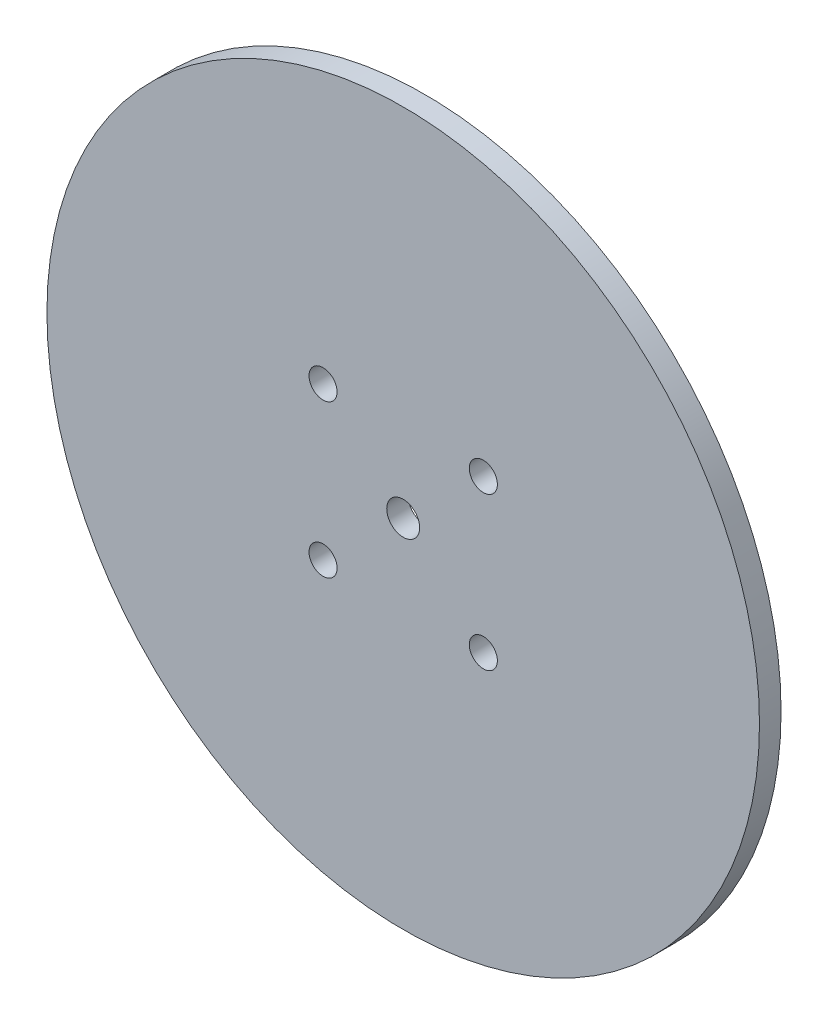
ISO-10303-21;
HEADER;
FILE_DESCRIPTION(('STEP AP214'),'2;1');
FILE_NAME('part.step','',(''),(''),'','','');
FILE_SCHEMA(('AUTOMOTIVE_DESIGN { 1 0 10303 214 1 1 1 1 }'));
ENDSEC;
DATA;
#1=APPLICATION_CONTEXT('core data for automotive mechanical design processes');
#2=APPLICATION_PROTOCOL_DEFINITION('international standard','automotive_design',2000,#1);
#3=PRODUCT_CONTEXT('',#1,'mechanical');
#4=PRODUCT('Part','Part','',(#3));
#5=PRODUCT_RELATED_PRODUCT_CATEGORY('part','',(#4));
#6=PRODUCT_DEFINITION_FORMATION('','',#4);
#7=PRODUCT_DEFINITION_CONTEXT('part definition',#1,'design');
#8=PRODUCT_DEFINITION('design','',#6,#7);
#9=PRODUCT_DEFINITION_SHAPE('','',#8);
#10=(LENGTH_UNIT() NAMED_UNIT(*) SI_UNIT(.MILLI.,.METRE.));
#11=(NAMED_UNIT(*) PLANE_ANGLE_UNIT() SI_UNIT($,.RADIAN.));
#12=(NAMED_UNIT(*) SI_UNIT($,.STERADIAN.) SOLID_ANGLE_UNIT());
#13=UNCERTAINTY_MEASURE_WITH_UNIT(LENGTH_MEASURE(1.E-05),#10,'distance_accuracy_value','');
#14=(GEOMETRIC_REPRESENTATION_CONTEXT(3) GLOBAL_UNCERTAINTY_ASSIGNED_CONTEXT((#13)) GLOBAL_UNIT_ASSIGNED_CONTEXT((#10,
#11,#12)) REPRESENTATION_CONTEXT('',''));
#15=CARTESIAN_POINT('',(0.,0.,0.));
#16=DIRECTION('',(0.,0.,1.));
#17=DIRECTION('',(1.,0.,0.));
#18=AXIS2_PLACEMENT_3D('',#15,#16,#17);
#19=CARTESIAN_POINT('',(0.,0.,4.));
#20=DIRECTION('',(0.,0.,-1.));
#21=DIRECTION('',(-1.,0.,0.));
#22=AXIS2_PLACEMENT_3D('',#19,#20,#21);
#23=CYLINDRICAL_SURFACE('',#22,66.);
#24=CARTESIAN_POINT('',(0.,0.,4.));
#25=DIRECTION('',(0.,0.,1.));
#26=DIRECTION('',(1.,0.,0.));
#27=AXIS2_PLACEMENT_3D('',#24,#25,#26);
#28=CIRCLE('',#27,66.);
#29=CARTESIAN_POINT('',(66.,0.,4.));
#30=VERTEX_POINT('',#29);
#31=EDGE_CURVE('E10',#30,#30,#28,.T.);
#32=ORIENTED_EDGE('',*,*,#31,.F.);
#33=EDGE_LOOP('',(#32));
#34=FACE_BOUND('',#33,.T.);
#35=CARTESIAN_POINT('',(0.,0.,0.));
#36=DIRECTION('',(0.,0.,1.));
#37=DIRECTION('',(1.,0.,0.));
#38=AXIS2_PLACEMENT_3D('',#35,#36,#37);
#39=CIRCLE('',#38,66.);
#40=CARTESIAN_POINT('',(66.,0.,0.));
#41=VERTEX_POINT('',#40);
#42=EDGE_CURVE('E46',#41,#41,#39,.T.);
#43=ORIENTED_EDGE('',*,*,#42,.T.);
#44=EDGE_LOOP('',(#43));
#45=FACE_BOUND('',#44,.T.);
#46=ADVANCED_FACE('F43',(#34,#45),#23,.T.);
#47=CARTESIAN_POINT('',(0.,0.,4.));
#48=DIRECTION('',(0.,0.,1.));
#49=DIRECTION('',(1.,0.,0.));
#50=AXIS2_PLACEMENT_3D('',#47,#48,#49);
#51=PLANE('',#50);
#52=CARTESIAN_POINT('',(0.,0.,4.));
#53=DIRECTION('',(0.,0.,-1.));
#54=DIRECTION('',(-1.,0.,0.));
#55=AXIS2_PLACEMENT_3D('',#52,#53,#54);
#56=CIRCLE('',#55,3.05);
#57=CARTESIAN_POINT('',(-3.05,0.,4.));
#58=VERTEX_POINT('',#57);
#59=EDGE_CURVE('E67',#58,#58,#56,.T.);
#60=ORIENTED_EDGE('',*,*,#59,.T.);
#61=EDGE_LOOP('',(#60));
#62=FACE_BOUND('',#61,.T.);
#63=CARTESIAN_POINT('',(14.845865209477,-14.136841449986,4.));
#64=DIRECTION('',(0.,0.,-1.));
#65=DIRECTION('',(-1.,0.,0.));
#66=AXIS2_PLACEMENT_3D('',#63,#64,#65);
#67=CIRCLE('',#66,2.6);
#68=CARTESIAN_POINT('',(12.245865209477,-14.136841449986,4.));
#69=VERTEX_POINT('',#68);
#70=EDGE_CURVE('E62',#69,#69,#67,.T.);
#71=ORIENTED_EDGE('',*,*,#70,.T.);
#72=EDGE_LOOP('',(#71));
#73=FACE_BOUND('',#72,.T.);
#74=CARTESIAN_POINT('',(-14.845865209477,-14.136841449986,4.));
#75=DIRECTION('',(0.,0.,-1.));
#76=DIRECTION('',(-1.,0.,0.));
#77=AXIS2_PLACEMENT_3D('',#74,#75,#76);
#78=CIRCLE('',#77,2.6);
#79=CARTESIAN_POINT('',(-17.445865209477,-14.136841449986,4.));
#80=VERTEX_POINT('',#79);
#81=EDGE_CURVE('E74',#80,#80,#78,.T.);
#82=ORIENTED_EDGE('',*,*,#81,.T.);
#83=EDGE_LOOP('',(#82));
#84=FACE_BOUND('',#83,.T.);
#85=CARTESIAN_POINT('',(-14.845865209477,14.136841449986,4.));
#86=DIRECTION('',(0.,0.,-1.));
#87=DIRECTION('',(-1.,0.,0.));
#88=AXIS2_PLACEMENT_3D('',#85,#86,#87);
#89=CIRCLE('',#88,2.6);
#90=CARTESIAN_POINT('',(-17.445865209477,14.136841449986,4.));
#91=VERTEX_POINT('',#90);
#92=EDGE_CURVE('E85',#91,#91,#89,.T.);
#93=ORIENTED_EDGE('',*,*,#92,.T.);
#94=EDGE_LOOP('',(#93));
#95=FACE_BOUND('',#94,.T.);
#96=CARTESIAN_POINT('',(14.845865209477,14.136841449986,4.));
#97=DIRECTION('',(0.,0.,-1.));
#98=DIRECTION('',(-1.,0.,0.));
#99=AXIS2_PLACEMENT_3D('',#96,#97,#98);
#100=CIRCLE('',#99,2.60000000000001);
#101=CARTESIAN_POINT('',(12.245865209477,14.136841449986,4.));
#102=VERTEX_POINT('',#101);
#103=EDGE_CURVE('E54',#102,#102,#100,.T.);
#104=ORIENTED_EDGE('',*,*,#103,.T.);
#105=EDGE_LOOP('',(#104));
#106=FACE_BOUND('',#105,.T.);
#107=ORIENTED_EDGE('',*,*,#31,.T.);
#108=EDGE_LOOP('',(#107));
#109=FACE_BOUND('',#108,.T.);
#110=ADVANCED_FACE('F97',(#62,#73,#84,#95,#106,#109),#51,.T.);
#111=CARTESIAN_POINT('',(0.,0.,0.));
#112=DIRECTION('',(0.,0.,1.));
#113=DIRECTION('',(1.,0.,0.));
#114=AXIS2_PLACEMENT_3D('',#111,#112,#113);
#115=PLANE('',#114);
#116=CARTESIAN_POINT('',(0.,0.,0.));
#117=DIRECTION('',(0.,0.,-1.));
#118=DIRECTION('',(-1.,0.,0.));
#119=AXIS2_PLACEMENT_3D('',#116,#117,#118);
#120=CIRCLE('',#119,3.05);
#121=CARTESIAN_POINT('',(-3.05,0.,0.));
#122=VERTEX_POINT('',#121);
#123=EDGE_CURVE('E88',#122,#122,#120,.T.);
#124=ORIENTED_EDGE('',*,*,#123,.F.);
#125=EDGE_LOOP('',(#124));
#126=FACE_BOUND('',#125,.T.);
#127=CARTESIAN_POINT('',(14.845865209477,-14.136841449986,0.));
#128=DIRECTION('',(0.,0.,-1.));
#129=DIRECTION('',(-1.,0.,0.));
#130=AXIS2_PLACEMENT_3D('',#127,#128,#129);
#131=CIRCLE('',#130,2.6);
#132=CARTESIAN_POINT('',(12.245865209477,-14.136841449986,0.));
#133=VERTEX_POINT('',#132);
#134=EDGE_CURVE('E68',#133,#133,#131,.T.);
#135=ORIENTED_EDGE('',*,*,#134,.F.);
#136=EDGE_LOOP('',(#135));
#137=FACE_BOUND('',#136,.T.);
#138=CARTESIAN_POINT('',(-14.845865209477,-14.136841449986,0.));
#139=DIRECTION('',(0.,0.,-1.));
#140=DIRECTION('',(-1.,0.,0.));
#141=AXIS2_PLACEMENT_3D('',#138,#139,#140);
#142=CIRCLE('',#141,2.6);
#143=CARTESIAN_POINT('',(-17.445865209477,-14.136841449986,0.));
#144=VERTEX_POINT('',#143);
#145=EDGE_CURVE('E76',#144,#144,#142,.T.);
#146=ORIENTED_EDGE('',*,*,#145,.F.);
#147=EDGE_LOOP('',(#146));
#148=FACE_BOUND('',#147,.T.);
#149=CARTESIAN_POINT('',(-14.845865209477,14.136841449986,0.));
#150=DIRECTION('',(0.,0.,-1.));
#151=DIRECTION('',(-1.,0.,0.));
#152=AXIS2_PLACEMENT_3D('',#149,#150,#151);
#153=CIRCLE('',#152,2.6);
#154=CARTESIAN_POINT('',(-17.445865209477,14.136841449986,0.));
#155=VERTEX_POINT('',#154);
#156=EDGE_CURVE('E63',#155,#155,#153,.T.);
#157=ORIENTED_EDGE('',*,*,#156,.F.);
#158=EDGE_LOOP('',(#157));
#159=FACE_BOUND('',#158,.T.);
#160=CARTESIAN_POINT('',(14.845865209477,14.136841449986,0.));
#161=DIRECTION('',(0.,0.,-1.));
#162=DIRECTION('',(-1.,0.,0.));
#163=AXIS2_PLACEMENT_3D('',#160,#161,#162);
#164=CIRCLE('',#163,2.60000000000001);
#165=CARTESIAN_POINT('',(12.245865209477,14.136841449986,0.));
#166=VERTEX_POINT('',#165);
#167=EDGE_CURVE('E60',#166,#166,#164,.T.);
#168=ORIENTED_EDGE('',*,*,#167,.F.);
#169=EDGE_LOOP('',(#168));
#170=FACE_BOUND('',#169,.T.);
#171=ORIENTED_EDGE('',*,*,#42,.F.);
#172=EDGE_LOOP('',(#171));
#173=FACE_BOUND('',#172,.T.);
#174=ADVANCED_FACE('F110',(#126,#137,#148,#159,#170,#173),#115,.F.);
#175=CARTESIAN_POINT('',(14.845865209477,14.136841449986,4.));
#176=DIRECTION('',(0.,0.,-1.));
#177=DIRECTION('',(-1.,0.,0.));
#178=AXIS2_PLACEMENT_3D('',#175,#176,#177);
#179=CYLINDRICAL_SURFACE('',#178,2.60000000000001);
#180=ORIENTED_EDGE('',*,*,#103,.F.);
#181=EDGE_LOOP('',(#180));
#182=FACE_BOUND('',#181,.T.);
#183=ORIENTED_EDGE('',*,*,#167,.T.);
#184=EDGE_LOOP('',(#183));
#185=FACE_BOUND('',#184,.T.);
#186=ADVANCED_FACE('F109',(#182,#185),#179,.F.);
#187=CARTESIAN_POINT('',(-14.845865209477,14.136841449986,4.));
#188=DIRECTION('',(0.,0.,-1.));
#189=DIRECTION('',(-1.,0.,0.));
#190=AXIS2_PLACEMENT_3D('',#187,#188,#189);
#191=CYLINDRICAL_SURFACE('',#190,2.6);
#192=ORIENTED_EDGE('',*,*,#92,.F.);
#193=EDGE_LOOP('',(#192));
#194=FACE_BOUND('',#193,.T.);
#195=ORIENTED_EDGE('',*,*,#156,.T.);
#196=EDGE_LOOP('',(#195));
#197=FACE_BOUND('',#196,.T.);
#198=ADVANCED_FACE('F135',(#194,#197),#191,.F.);
#199=CARTESIAN_POINT('',(-14.845865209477,-14.136841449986,4.));
#200=DIRECTION('',(0.,0.,-1.));
#201=DIRECTION('',(-1.,0.,0.));
#202=AXIS2_PLACEMENT_3D('',#199,#200,#201);
#203=CYLINDRICAL_SURFACE('',#202,2.6);
#204=ORIENTED_EDGE('',*,*,#81,.F.);
#205=EDGE_LOOP('',(#204));
#206=FACE_BOUND('',#205,.T.);
#207=ORIENTED_EDGE('',*,*,#145,.T.);
#208=EDGE_LOOP('',(#207));
#209=FACE_BOUND('',#208,.T.);
#210=ADVANCED_FACE('F137',(#206,#209),#203,.F.);
#211=CARTESIAN_POINT('',(14.845865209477,-14.136841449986,4.));
#212=DIRECTION('',(0.,0.,-1.));
#213=DIRECTION('',(-1.,0.,0.));
#214=AXIS2_PLACEMENT_3D('',#211,#212,#213);
#215=CYLINDRICAL_SURFACE('',#214,2.6);
#216=ORIENTED_EDGE('',*,*,#70,.F.);
#217=EDGE_LOOP('',(#216));
#218=FACE_BOUND('',#217,.T.);
#219=ORIENTED_EDGE('',*,*,#134,.T.);
#220=EDGE_LOOP('',(#219));
#221=FACE_BOUND('',#220,.T.);
#222=ADVANCED_FACE('F101',(#218,#221),#215,.F.);
#223=CARTESIAN_POINT('',(0.,0.,4.));
#224=DIRECTION('',(0.,0.,-1.));
#225=DIRECTION('',(-1.,0.,0.));
#226=AXIS2_PLACEMENT_3D('',#223,#224,#225);
#227=CYLINDRICAL_SURFACE('',#226,3.05);
#228=ORIENTED_EDGE('',*,*,#59,.F.);
#229=EDGE_LOOP('',(#228));
#230=FACE_BOUND('',#229,.T.);
#231=ORIENTED_EDGE('',*,*,#123,.T.);
#232=EDGE_LOOP('',(#231));
#233=FACE_BOUND('',#232,.T.);
#234=ADVANCED_FACE('F99',(#230,#233),#227,.F.);
#235=CLOSED_SHELL('',(#46,#110,#174,#186,#198,#210,#222,#234));
#236=MANIFOLD_SOLID_BREP('B2',#235);
#237=ADVANCED_BREP_SHAPE_REPRESENTATION('',(#18,#236),#14);
#238=SHAPE_DEFINITION_REPRESENTATION(#9,#237);
ENDSEC;
END-ISO-10303-21;
